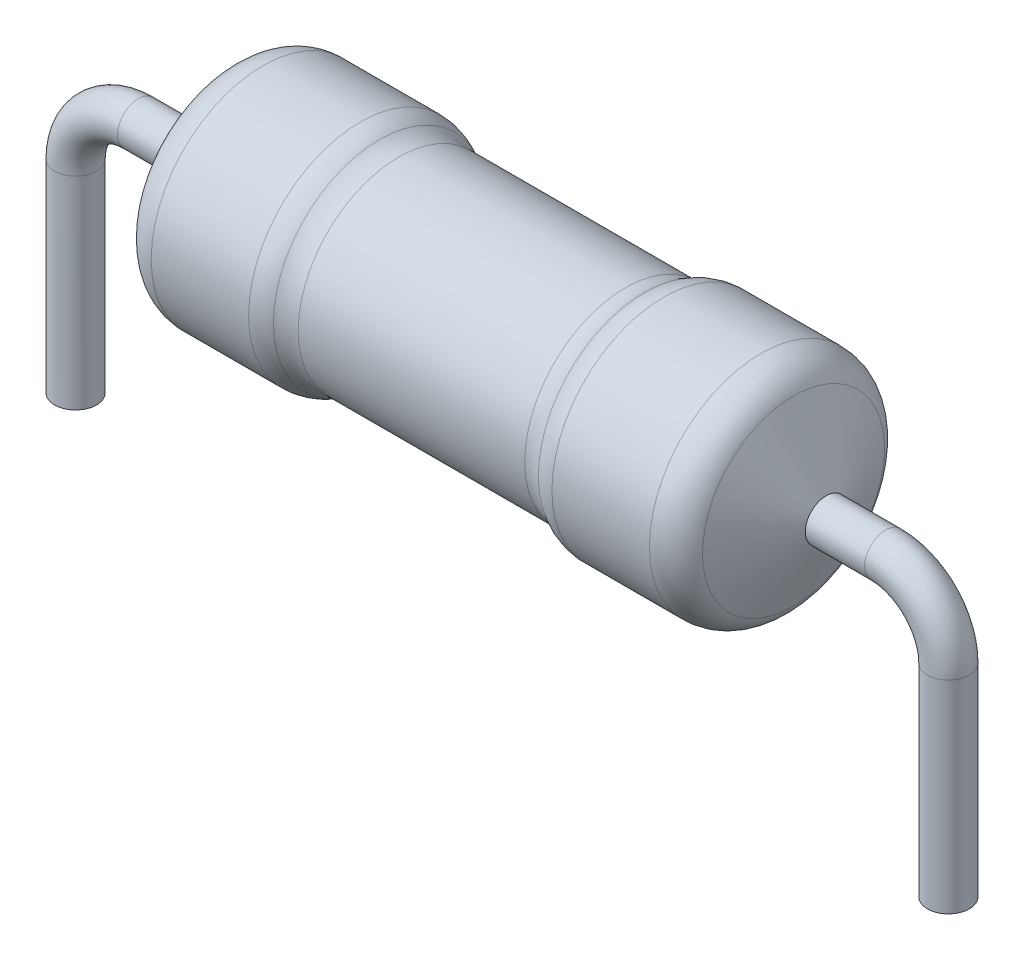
from build123d import *

# Parameters (mm, degrees)
SKETCH_2_R = 0.3


with BuildPart() as part:
    # Sketch 1 → Revolve 1 (revolve)
    with BuildSketch(Plane.XY, mode=Mode.PRIVATE) as revolve_1_sk:
        with BuildLine():
            Line((-4.5, 1.6), (-4.5, 1.3))
            Line((-4.5, 1.3), (-4.031649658, 0.29561945))
            ThreePointArc((-4.031649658, 0.29561945), (-3.84271747, 0.08018358), (-3.567620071, 0))
            Line((-3.567620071, 0), (-2.171806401, 0))
            ThreePointArc((-2.171806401, 0), (-2.028698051, 0.020406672), (-1.896997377, 0.08))
            ThreePointArc((-1.896997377, 0.08), (-1.765296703, 0.139593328), (-1.622188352, 0.16))
            Line((-1.622188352, 0.16), (1.622188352, 0.16))
            ThreePointArc((1.622188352, 0.16), (1.765296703, 0.139593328), (1.896997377, 0.08))
            ThreePointArc((1.896997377, 0.08), (2.028698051, 0.020406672), (2.171806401, 0))
            Line((2.171806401, 0), (3.567620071, 0))
            ThreePointArc((3.567620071, 0), (3.84271747, 0.08018358), (4.031649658, 0.29561945))
            Line((4.031649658, 0.29561945), (4.5, 1.3))
            Line((4.5, 1.3), (4.5, 1.6))
            Line((4.5, 1.6), (-4.5, 1.6))
        make_face()
    revolve(revolve_1_sk.sketch.rotate(Axis((-4.5, 1.6, 0), (1, 0, 0)), 270), axis=Axis((-4.5, 1.6, 0), (1, 0, 0)))

    # Sweep 1: sweep along a path in Sketch 3
    with BuildLine(Plane.XY) as sweep_1_path:
        Line((-6.25, -2.2), (-6.25, 0.7))
        ThreePointArc((-6.25, 0.7), (-5.986396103, 1.336396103), (-5.35, 1.6))
        Line((-5.35, 1.6), (5.35, 1.6))
        ThreePointArc((5.35, 1.6), (5.986396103, 1.336396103), (6.25, 0.7))
        Line((6.25, 0.7), (6.25, -2.2))
    # Sketch 2 → Sweep 1 (sweep)
    with BuildSketch(Plane(origin=(0, -2.2, 0), x_dir=(-1, 0, 0), z_dir=(0, 1, 0))):
        with Locations((6.25, 0)):
            Circle(SKETCH_2_R)
    sweep(path=sweep_1_path.line)


solid = part.part
